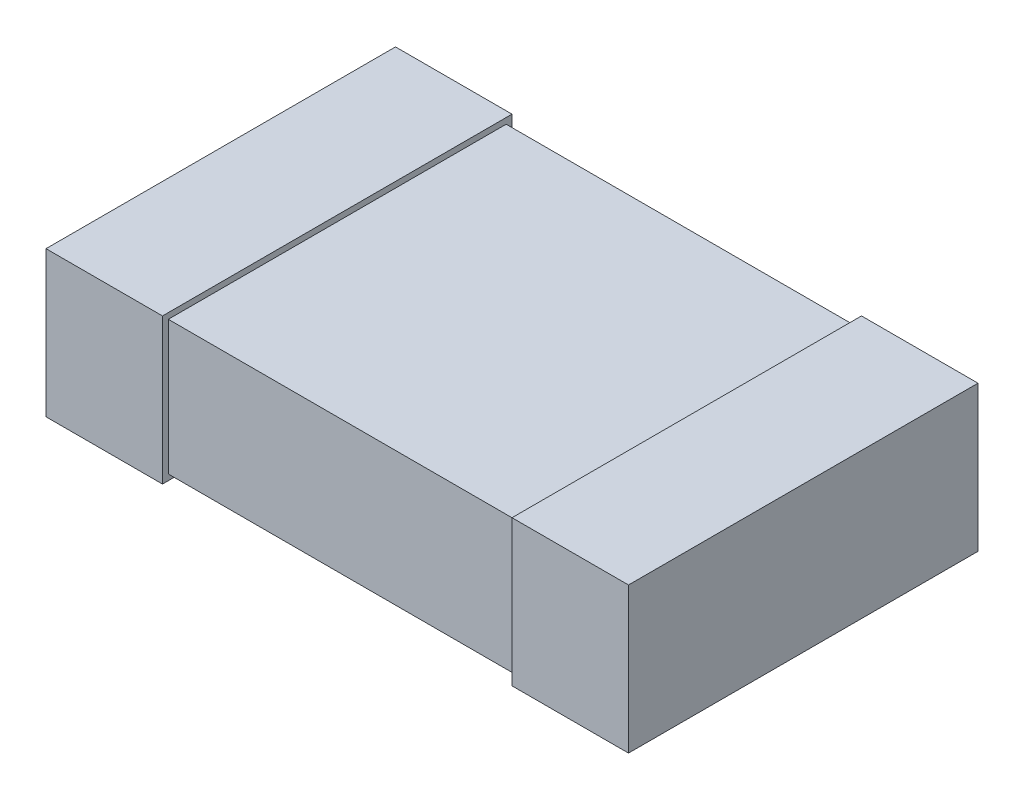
from build123d import *

# Parameters (mm, degrees)
SKETCH_1_W        = 0.4
SKETCH_1_H        = 1.2
EXTRUDE_1_DEPTH   = 0.5
EXTRUDE_1_2_DEPTH = 0.5
SKETCH_2_W        = 1.16
SKETCH_2_H        = 0.46
EXTRUDE_2_DEPTH   = 1.2


with BuildPart() as part:
    # Sketch 1 → Extrude 1 (new body)
    with BuildSketch(Plane(origin=(0, 0, 0), x_dir=(1, 0, 0), z_dir=(0, 1, 0))):
        with Locations((-0.8, 0)):
            Rectangle(SKETCH_1_W, SKETCH_1_H)
    extrude(amount=EXTRUDE_1_DEPTH)



with BuildPart() as body_2:
    # Sketch 1 → Extrude 1 2 (new body)
    with BuildSketch(Plane(origin=(0, 0, 0), x_dir=(1, 0, 0), z_dir=(0, 1, 0))):
        with Locations((0.8, 0)):
            Rectangle(SKETCH_1_W, SKETCH_1_H)
    extrude(amount=EXTRUDE_1_2_DEPTH)


with BuildPart() as part_1:
    add(part.part)

    add(body_2.part)  # Extrude 2 merges body 2
    # Sketch 2 → Extrude 2 (add)
    with BuildSketch(Plane(origin=(-0.6, 0, 0), x_dir=(0, 0, -1), z_dir=(1, 0, 0))):
        with Locations((0, 0.25)):
            Rectangle(SKETCH_2_W, SKETCH_2_H)
    extrude(amount=EXTRUDE_2_DEPTH)


solid = part_1.part
